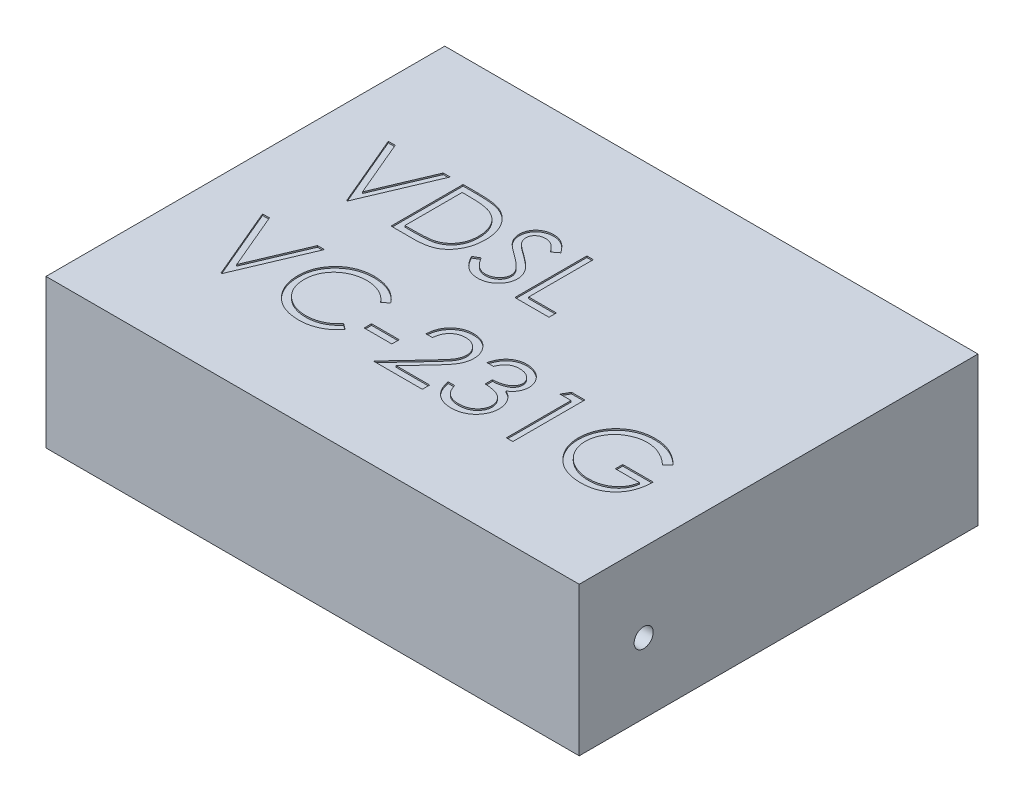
from build123d import *

# Parameters (mm, degrees)
SKETCH1_W           = 94
SKETCH1_H           = 70.3
BOSS_EXTRUDE1_DEPTH = 26.2
SKETCH2_W           = 4.884615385
SKETCH2_H           = 1.302564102
CUT_EXTRUDE1_DEPTH  = 0.254
CUT_EXTRUDE2_DEPTH  = 2.54
SKETCH4_R           = 1.681264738
CUT_EXTRUDE3_DEPTH  = 2.54


with BuildPart() as part:
    # Sketch1 → Boss-Extrude1 (new body)
    with BuildSketch(Plane(origin=(0, 0, 0), x_dir=(1, 0, 0), z_dir=(0, 1, 0))):
        with Locations((47, 35.15)):
            Rectangle(SKETCH1_W, SKETCH1_H)
    extrude(amount=BOSS_EXTRUDE1_DEPTH)

    # Sketch2 → Cut-Extrude1 (cut)
    # profile 1 of 11: a face of its own
    with BuildSketch(Plane(origin=(0, 26.2, 0), x_dir=(1, 0, 0), z_dir=(0, 1, 0))):
        Polygon((9.541282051, 50.8), (10.762435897, 50.8), (14.99322516, 40.799258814), (19.226558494, 50.8), (20.45025641, 50.8), (15.077179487, 38.1), (14.914358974, 38.1), align=None)
    # profile 2 of 11: a face of its own
    with BuildSketch(Plane(origin=(0, 26.2, 0), x_dir=(1, 0, 0), z_dir=(0, 1, 0))):
        with BuildLine():
            Line((22.72974359, 38.1), (22.72974359, 50.8))
            Line((22.72974359, 50.8), (25.294166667, 50.8))
            add(Edge.make_bspline(
                [(25.294166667, 50.8), (25.517211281, 50.798394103), (25.948132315, 50.795291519), (26.570840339, 50.775619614), (27.146998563, 50.740819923), (27.67471208, 50.6901305), (28.15542962, 50.627889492), (28.587805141, 50.549873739), (28.974074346, 50.45775095), (29.211634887, 50.379208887), (29.323974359, 50.342067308)],
                knots=[0, 0, 0, 0, 1.314313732, 2.53924729, 3.670748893, 4.714932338, 5.66265055, 6.526160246, 7.303039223, 8, 8, 8, 8], degree=3))
            add(Edge.make_bspline(
                [(29.323974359, 50.342067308), (29.470912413, 50.28607589), (29.761456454, 50.175362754), (30.175139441, 49.966515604), (30.564577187, 49.729885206), (30.931858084, 49.465159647), (31.268592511, 49.164843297), (31.587935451, 48.841693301), (31.876823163, 48.483958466), (32.141376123, 48.099057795), (32.379902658, 47.691525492), (32.587236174, 47.262138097), (32.759426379, 46.813076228), (32.902367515, 46.345588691), (33.015021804, 45.858647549), (33.091881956, 45.351685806), (33.142576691, 44.826707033), (33.147671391, 44.470473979), (33.15025641, 44.289723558)],
                knots=[0, 0, 0, 0, 0.984719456, 1.947108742, 2.898477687, 3.838006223, 4.779231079, 5.722358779, 6.681677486, 7.655904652, 8.64651281, 9.637519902, 10.640069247, 11.656948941, 12.698408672, 13.768548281, 14.867775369, 16, 16, 16, 16], degree=3))
            add(Edge.make_bspline(
                [(33.15025641, 44.289723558), (33.147974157, 44.132747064), (33.143476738, 43.823408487), (33.103093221, 43.367511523), (33.044396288, 42.925139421), (32.953521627, 42.498398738), (32.843203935, 42.083550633), (32.701819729, 41.685016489), (32.539856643, 41.299140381), (32.350989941, 40.931139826), (32.143648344, 40.582494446), (31.921138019, 40.253834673), (31.683696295, 39.949850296), (31.429058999, 39.669620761), (31.160516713, 39.41356852), (30.876311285, 39.179554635), (30.575709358, 38.972157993), (30.260057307, 38.783228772), (29.920146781, 38.618417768), (29.549539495, 38.478971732), (29.146654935, 38.363414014), (28.712482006, 38.26699962), (28.246270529, 38.190519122), (27.747563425, 38.139260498), (27.217126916, 38.104597), (26.852893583, 38.101562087), (26.665420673, 38.1)],
                knots=[0, 0, 0, 0, 1.105936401, 2.179363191, 3.223086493, 4.248585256, 5.251745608, 6.245858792, 7.225916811, 8.198733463, 9.158002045, 10.082870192, 10.993790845, 11.873723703, 12.748670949, 13.606408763, 14.465103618, 15.319838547, 16.196477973, 17.123216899, 18.106603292, 19.147568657, 20.255746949, 21.433717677, 22.679120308, 24, 24, 24, 24], degree=3))
            Line((26.665420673, 38.1), (22.72974359, 38.1))
        make_face()
        with BuildLine():
            Line((23.869487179, 39.402564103), (25.327239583, 39.402564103))
            add(Edge.make_bspline(
                [(25.327239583, 39.402564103), (25.5367111, 39.403464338), (25.93960154, 39.40519582), (26.518931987, 39.420389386), (27.048265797, 39.445215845), (27.527678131, 39.479959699), (27.956898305, 39.525928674), (28.336823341, 39.577181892), (28.666207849, 39.641035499), (28.865523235, 39.698914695), (28.957628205, 39.725661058)],
                knots=[0, 0, 0, 0, 1.375205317, 2.645023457, 3.804390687, 4.853969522, 5.800190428, 6.637939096, 7.370582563, 8, 8, 8, 8], degree=3))
            add(Edge.make_bspline(
                [(28.957628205, 39.725661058), (29.073555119, 39.76648814), (29.302640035, 39.847167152), (29.632408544, 39.994333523), (29.939955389, 40.168657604), (30.230640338, 40.36243157), (30.500339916, 40.58248992), (30.752250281, 40.824047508), (30.985864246, 41.088333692), (31.198768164, 41.375020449), (31.389298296, 41.682323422), (31.554293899, 42.007221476), (31.698898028, 42.346154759), (31.812394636, 42.704327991), (31.901351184, 43.078539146), (31.964360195, 43.468814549), (32.003602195, 43.875081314), (32.008179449, 44.151404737), (32.010512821, 44.292267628)],
                knots=[0, 0, 0, 0, 0.998632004, 1.973411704, 2.929992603, 3.868527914, 4.809262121, 5.754881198, 6.702106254, 7.672490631, 8.653608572, 9.636854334, 10.631411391, 11.644891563, 12.686317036, 13.754757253, 14.855430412, 16, 16, 16, 16], degree=3))
            add(Edge.make_bspline(
                [(32.010512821, 44.292267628), (32.008650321, 44.440797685), (32.004991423, 44.732586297), (31.959001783, 45.160723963), (31.891794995, 45.572496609), (31.794608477, 45.967931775), (31.670762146, 46.347800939), (31.516204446, 46.710003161), (31.339614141, 47.058363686), (31.129507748, 47.384842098), (30.899399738, 47.693608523), (30.644028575, 47.976473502), (30.367451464, 48.234081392), (30.07268501, 48.470444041), (29.751421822, 48.676052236), (29.411229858, 48.859972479), (29.047118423, 49.016058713), (28.793798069, 49.099076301), (28.665060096, 49.141266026)],
                knots=[0, 0, 0, 0, 1.122418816, 2.205001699, 3.251619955, 4.274784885, 5.280384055, 6.268708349, 7.249350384, 8.229342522, 9.199999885, 10.157847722, 11.105861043, 12.055065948, 13.010012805, 13.98527497, 14.976112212, 16, 16, 16, 16], degree=3))
            add(Edge.make_bspline(
                [(28.665060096, 49.141266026), (28.558557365, 49.170717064), (28.332103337, 49.233338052), (27.962571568, 49.301647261), (27.546682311, 49.361897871), (27.08258911, 49.412908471), (26.570820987, 49.449511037), (26.010984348, 49.476984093), (25.402837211, 49.495513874), (24.981260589, 49.496779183), (24.762455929, 49.497435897)],
                knots=[0, 0, 0, 0, 0.674548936, 1.434276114, 2.292660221, 3.240891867, 4.284742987, 5.42552168, 6.663806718, 8, 8, 8, 8], degree=3))
            Line((24.762455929, 49.497435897), (23.869487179, 49.497435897))
            Line((23.869487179, 49.497435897), (23.869487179, 39.402564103))
        make_face(mode=Mode.SUBTRACT)
    # profile 3 of 11: a face of its own
    with BuildSketch(Plane(origin=(0, 26.2, 0), x_dir=(1, 0, 0), z_dir=(0, 1, 0))):
        with BuildLine():
            Line((34.452820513, 40.549939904), (35.526418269, 41.193589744))
            add(Edge.make_bspline(
                [(35.526418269, 41.193589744), (35.626270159, 41.026441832), (35.817582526, 40.706192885), (36.136720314, 40.273456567), (36.467402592, 39.905656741), (36.812078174, 39.604933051), (37.168643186, 39.368172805), (37.539425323, 39.200524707), (37.923175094, 39.095963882), (38.184337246, 39.083263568), (38.314719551, 39.076923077)],
                knots=[0, 0, 0, 0, 1.272034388, 2.437168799, 3.508375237, 4.49857839, 5.41946034, 6.295179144, 7.148887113, 8, 8, 8, 8], degree=3))
            add(Edge.make_bspline(
                [(38.314719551, 39.076923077), (38.426069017, 39.080024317), (38.646819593, 39.086172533), (38.971802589, 39.145248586), (39.287422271, 39.236006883), (39.587173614, 39.365985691), (39.866920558, 39.523242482), (40.112236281, 39.713184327), (40.324312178, 39.92584113), (40.497790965, 40.163086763), (40.630887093, 40.418237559), (40.733184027, 40.680133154), (40.789953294, 40.952887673), (40.798504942, 41.136531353), (40.802820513, 41.229206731)],
                knots=[0, 0, 0, 0, 1.095163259, 2.171163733, 3.241058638, 4.321873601, 5.38011039, 6.391990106, 7.366004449, 8.327778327, 9.272591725, 10.192022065, 11.087607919, 12, 12, 12, 12], degree=3))
            add(Edge.make_bspline(
                [(40.802820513, 41.229206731), (40.797470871, 41.334946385), (40.786595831, 41.549899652), (40.694678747, 41.867035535), (40.550082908, 42.180880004), (40.416687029, 42.375013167), (40.347431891, 42.475801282)],
                knots=[0, 0, 0, 0, 0.938893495, 1.908633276, 2.914225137, 4, 4, 4, 4], degree=3))
            add(Edge.make_bspline(
                [(40.347431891, 42.475801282), (40.290569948, 42.548542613), (40.171195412, 42.70125394), (39.965972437, 42.928566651), (39.725158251, 43.1630392), (39.456993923, 43.413624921), (39.151711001, 43.668669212), (38.818871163, 43.940334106), (38.449976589, 44.2182884), (38.191261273, 44.404697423), (38.057768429, 44.50088141)],
                knots=[0, 0, 0, 0, 0.722233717, 1.516239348, 2.393582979, 3.351407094, 4.387010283, 5.505090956, 6.712668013, 8, 8, 8, 8], degree=3))
            add(Edge.make_bspline(
                [(38.057768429, 44.50088141), (37.924149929, 44.596053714), (37.668681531, 44.778015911), (37.311417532, 45.048069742), (36.991941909, 45.294971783), (36.711674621, 45.521046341), (36.470738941, 45.726324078), (36.267236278, 45.908833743), (36.106350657, 46.073511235), (36.016886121, 46.180341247), (35.97671875, 46.228305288)],
                knots=[0, 0, 0, 0, 1.452282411, 2.77665338, 3.964542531, 5.026858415, 5.96415736, 6.766646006, 7.446254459, 8, 8, 8, 8], degree=3))
            add(Edge.make_bspline(
                [(35.97671875, 46.228305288), (35.920575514, 46.303057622), (35.810162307, 46.450068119), (35.664417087, 46.679846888), (35.540540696, 46.915062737), (35.443431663, 47.156347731), (35.361657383, 47.400314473), (35.306655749, 47.650146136), (35.272215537, 47.904721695), (35.268688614, 48.076039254), (35.266923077, 48.161798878)],
                knots=[0, 0, 0, 0, 1.068054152, 2.10047183, 3.106115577, 4.101338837, 5.06977816, 6.043150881, 7.020423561, 8, 8, 8, 8], degree=3))
            add(Edge.make_bspline(
                [(35.266923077, 48.161798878), (35.271659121, 48.29616406), (35.281029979, 48.562022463), (35.360279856, 48.950391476), (35.485367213, 49.32118219), (35.660608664, 49.670723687), (35.886513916, 49.989914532), (36.14793788, 50.282426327), (36.459310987, 50.528329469), (36.800950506, 50.743184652), (37.174897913, 50.911354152), (37.56675062, 51.038212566), (37.977131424, 51.110091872), (38.255091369, 51.120407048), (38.396129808, 51.125641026)],
                knots=[0, 0, 0, 0, 1.005424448, 1.989358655, 2.955360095, 3.929531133, 4.905563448, 5.876582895, 6.856512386, 7.866279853, 8.892233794, 9.918561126, 10.94386622, 12, 12, 12, 12], degree=3))
            add(Edge.make_bspline(
                [(38.396129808, 51.125641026), (38.545786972, 51.120479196), (38.843407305, 51.110213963), (39.281191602, 51.020960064), (39.702689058, 50.873274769), (40.041754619, 50.705675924), (40.307122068, 50.538284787), (40.509497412, 50.385812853), (40.714575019, 50.210280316), (40.924009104, 50.011219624), (41.134250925, 49.78680427), (41.348421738, 49.538571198), (41.56702237, 49.26803741), (41.707650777, 49.074908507), (41.77974359, 48.975901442)],
                knots=[0, 0, 0, 0, 1.286793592, 2.559021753, 3.825965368, 5.121522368, 5.803751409, 6.523245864, 7.299691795, 8.125521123, 9.008227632, 9.944561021, 10.946284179, 12, 12, 12, 12], degree=3))
            Line((41.77974359, 48.975901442), (40.749395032, 48.194871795))
            add(Edge.make_bspline(
                [(40.749395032, 48.194871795), (40.687179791, 48.275022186), (40.567367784, 48.429373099), (40.385469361, 48.645531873), (40.214024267, 48.842985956), (40.045112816, 49.014490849), (39.887655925, 49.16943859), (39.734831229, 49.302098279), (39.588838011, 49.413769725), (39.404808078, 49.532944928), (39.173603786, 49.651078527), (38.883374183, 49.751042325), (38.580075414, 49.811113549), (38.373502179, 49.819056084), (38.268926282, 49.823076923)],
                knots=[0, 0, 0, 0, 1.181633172, 2.275549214, 3.290209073, 4.226197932, 5.078386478, 5.862611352, 6.581680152, 7.217281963, 8.414376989, 9.595101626, 10.782541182, 12, 12, 12, 12], degree=3))
            add(Edge.make_bspline(
                [(38.268926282, 49.823076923), (38.137729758, 49.818680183), (37.88472962, 49.810201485), (37.525536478, 49.717600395), (37.202252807, 49.571797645), (36.924476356, 49.367454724), (36.693202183, 49.125352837), (36.525905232, 48.846755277), (36.425211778, 48.539116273), (36.41292442, 48.324516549), (36.406666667, 48.215224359)],
                knots=[0, 0, 0, 0, 1.14458467, 2.207223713, 3.21896685, 4.227309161, 5.202851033, 6.127160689, 7.046193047, 8, 8, 8, 8], degree=3))
            add(Edge.make_bspline(
                [(36.406666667, 48.215224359), (36.408093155, 48.14718328), (36.410948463, 48.010989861), (36.450771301, 47.809780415), (36.501931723, 47.609079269), (36.583003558, 47.409788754), (36.694927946, 47.208423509), (36.84190387, 47.001516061), (37.027009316, 46.787242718), (37.168803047, 46.647878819), (37.243665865, 46.574298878)],
                knots=[0, 0, 0, 0, 0.858281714, 1.717966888, 2.583508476, 3.4729293, 4.427298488, 5.488583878, 6.674047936, 8, 8, 8, 8], degree=3))
            add(Edge.make_bspline(
                [(37.243665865, 46.574298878), (37.271465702, 46.549490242), (37.337511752, 46.4905506), (37.458255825, 46.39405861), (37.617705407, 46.275031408), (37.811696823, 46.127757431), (38.043806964, 45.956918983), (38.314061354, 45.764700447), (38.619447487, 45.544861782), (38.836152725, 45.39116442), (38.950737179, 45.309895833)],
                knots=[0, 0, 0, 0, 0.420754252, 0.999615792, 1.744751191, 2.668019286, 3.750313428, 4.999500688, 6.413464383, 8, 8, 8, 8], degree=3))
            add(Edge.make_bspline(
                [(38.950737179, 45.309895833), (39.088571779, 45.209597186), (39.355469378, 45.015382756), (39.735226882, 44.723588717), (40.079555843, 44.438209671), (40.389665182, 44.161068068), (40.668618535, 43.894266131), (40.913321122, 43.634594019), (41.126266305, 43.383912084), (41.355516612, 43.062520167), (41.589769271, 42.667800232), (41.790942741, 42.184190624), (41.917791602, 41.698701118), (41.934379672, 41.372395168), (41.942564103, 41.211398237)],
                knots=[0, 0, 0, 0, 1.163667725, 2.253281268, 3.268753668, 4.215851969, 5.092017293, 5.902905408, 6.650798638, 7.335211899, 8.59617414, 9.77448103, 10.901945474, 12, 12, 12, 12], degree=3))
            add(Edge.make_bspline(
                [(41.942564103, 41.211398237), (41.94017963, 41.097539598), (41.93545699, 40.872033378), (41.881170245, 40.540907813), (41.801633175, 40.219304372), (41.681755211, 39.911198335), (41.535439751, 39.610953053), (41.349779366, 39.326444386), (41.134577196, 39.051375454), (40.88771182, 38.793081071), (40.617579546, 38.555967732), (40.33207014, 38.34504228), (40.030716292, 38.169171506), (39.7151528, 38.025658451), (39.385307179, 37.913413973), (39.041290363, 37.832087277), (38.68253528, 37.782173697), (38.438693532, 37.776992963), (38.314719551, 37.774358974)],
                knots=[0, 0, 0, 0, 0.983748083, 1.948392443, 2.894712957, 3.844097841, 4.80183111, 5.778335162, 6.776009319, 7.81870978, 8.863265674, 9.881300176, 10.883814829, 11.87499822, 12.874611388, 13.892143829, 14.928324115, 16, 16, 16, 16], degree=3))
            add(Edge.make_bspline(
                [(38.314719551, 37.774358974), (38.218797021, 37.776213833), (38.028160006, 37.779900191), (37.7461856, 37.812489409), (37.469907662, 37.858598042), (37.202792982, 37.931801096), (36.941400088, 38.020617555), (36.686865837, 38.129976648), (36.43906687, 38.261030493), (36.196614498, 38.41087244), (35.96012535, 38.585253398), (35.731817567, 38.788357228), (35.504200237, 39.014582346), (35.283991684, 39.270072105), (35.066737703, 39.550698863), (34.85672176, 39.859088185), (34.64959667, 40.193560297), (34.519637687, 40.428927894), (34.452820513, 40.549939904)],
                knots=[0, 0, 0, 0, 0.915332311, 1.819136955, 2.706846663, 3.586547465, 4.459518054, 5.340707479, 6.227863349, 7.133153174, 8.059268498, 9.028702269, 10.047606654, 11.120612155, 12.245963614, 13.433783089, 14.680604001, 16, 16, 16, 16], degree=3))
        make_face()
    # profile 4 of 11: a face of its own
    with BuildSketch(Plane(origin=(0, 26.2, 0), x_dir=(1, 0, 0), z_dir=(0, 1, 0))):
        Polygon((44.547692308, 50.8), (45.687435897, 50.8), (45.687435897, 39.402564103), (50.572051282, 39.402564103), (50.572051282, 38.1), (44.547692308, 38.1), align=None)
    # profile 5 of 11: a face of its own
    with BuildSketch(Plane(origin=(0, 26.2, 0), x_dir=(1, 0, 0), z_dir=(0, 1, 0))):
        Polygon((9.541282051, 28.633333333), (10.762435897, 28.633333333), (14.99322516, 18.632592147), (19.226558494, 28.633333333), (20.45025641, 28.633333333), (15.077179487, 15.933333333), (14.914358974, 15.933333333), align=None)
    # profile 6 of 11: a face of its own
    with BuildSketch(Plane(origin=(0, 26.2, 0), x_dir=(1, 0, 0), z_dir=(0, 1, 0))):
        with BuildLine():
            Line((34.452820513, 26.302964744), (33.455544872, 25.53974359))
            add(Edge.make_bspline(
                [(33.455544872, 25.53974359), (33.384403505, 25.62452868), (33.243079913, 25.792955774), (33.015716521, 26.029464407), (32.778764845, 26.25104407), (32.532315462, 26.458750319), (32.271932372, 26.645319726), (32.003923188, 26.820474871), (31.723804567, 26.977474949), (31.336448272, 27.167840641), (30.82972608, 27.366490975), (30.19184195, 27.533054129), (29.525958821, 27.639085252), (29.071670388, 27.650569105), (28.840600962, 27.656410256)],
                knots=[0, 0, 0, 0, 0.757959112, 1.505699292, 2.245454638, 2.979532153, 3.711538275, 4.438200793, 5.171680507, 5.909471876, 7.393775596, 8.890124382, 10.418191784, 12, 12, 12, 12], degree=3))
            add(Edge.make_bspline(
                [(28.840600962, 27.656410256), (28.713298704, 27.65494445), (28.459875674, 27.65202644), (28.083779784, 27.613530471), (27.714706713, 27.559424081), (27.352896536, 27.479140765), (26.9988098, 27.377640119), (26.650131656, 27.256353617), (26.311910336, 27.106294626), (25.979467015, 26.94043894), (25.660953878, 26.753105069), (25.359582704, 26.54876805), (25.076452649, 26.329714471), (24.811339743, 26.095123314), (24.563972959, 25.846051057), (24.336144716, 25.579843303), (24.128643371, 25.297351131), (23.93735588, 25.002299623), (23.766041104, 24.695548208), (23.622604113, 24.375961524), (23.495585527, 24.04901235), (23.395076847, 23.711006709), (23.315522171, 23.364322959), (23.260630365, 23.008030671), (23.222572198, 22.642874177), (23.219668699, 22.395371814), (23.218205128, 22.270612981)],
                knots=[0, 0, 0, 0, 1.054917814, 2.100044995, 3.131103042, 4.146048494, 5.169673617, 6.183595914, 7.203665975, 8.234915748, 9.262203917, 10.264457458, 11.251630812, 12.227803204, 13.197192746, 14.159520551, 15.12972552, 16.100847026, 17.073214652, 18.039054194, 19.002613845, 19.979014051, 20.95965708, 21.949030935, 22.966165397, 24, 24, 24, 24], degree=3))
            add(Edge.make_bspline(
                [(23.218205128, 22.270612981), (23.222783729, 22.082902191), (23.231773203, 21.714356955), (23.311777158, 21.174532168), (23.433352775, 20.657385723), (23.615563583, 20.166150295), (23.840241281, 19.694768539), (24.124142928, 19.251216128), (24.452951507, 18.828790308), (24.831318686, 18.437474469), (25.246448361, 18.08001038), (25.691847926, 17.765229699), (26.166408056, 17.502829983), (26.664888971, 17.284477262), (27.191126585, 17.116631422), (27.744174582, 16.998470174), (28.322830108, 16.921391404), (28.718233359, 16.914012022), (28.919467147, 16.91025641)],
                knots=[0, 0, 0, 0, 1.029171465, 2.020641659, 2.987623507, 3.938342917, 4.889210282, 5.84687017, 6.821220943, 7.821438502, 8.827599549, 9.822697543, 10.807740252, 11.797342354, 12.80366471, 13.83203677, 14.896651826, 16, 16, 16, 16], degree=3))
            add(Edge.make_bspline(
                [(28.919467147, 16.91025641), (29.141182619, 16.916384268), (29.577571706, 16.928445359), (30.217535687, 17.030623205), (30.830168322, 17.196296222), (31.415502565, 17.428154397), (31.971888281, 17.729562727), (32.500196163, 18.094952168), (33.000872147, 18.527798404), (33.301939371, 18.858300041), (33.455544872, 19.026923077)],
                knots=[0, 0, 0, 0, 1.028121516, 2.023589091, 2.998037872, 3.967518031, 4.937445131, 5.927275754, 6.942489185, 8, 8, 8, 8], degree=3))
            Line((33.455544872, 19.026923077), (34.452820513, 18.271334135))
            add(Edge.make_bspline(
                [(34.452820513, 18.271334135), (34.372563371, 18.167780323), (34.212433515, 17.961168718), (33.953142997, 17.669897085), (33.679993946, 17.395925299), (33.390957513, 17.141462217), (33.089358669, 16.901416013), (32.769781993, 16.682606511), (32.436428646, 16.481979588), (32.090428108, 16.298276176), (31.732147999, 16.135290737), (31.362017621, 15.995758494), (30.98163239, 15.875562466), (30.590974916, 15.776676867), (30.189234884, 15.69949322), (29.777862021, 15.647896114), (29.355968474, 15.612546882), (29.071338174, 15.609325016), (28.927099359, 15.607692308)],
                knots=[0, 0, 0, 0, 0.986787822, 1.968848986, 2.935600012, 3.899624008, 4.868462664, 5.837806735, 6.815139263, 7.798259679, 8.787526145, 9.778297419, 10.776456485, 11.791383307, 12.812564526, 13.85620153, 14.913611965, 16, 16, 16, 16], degree=3))
            add(Edge.make_bspline(
                [(28.927099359, 15.607692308), (28.790506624, 15.608642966), (28.520411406, 15.610522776), (28.121635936, 15.640974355), (27.7334166, 15.682520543), (27.356862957, 15.74507759), (26.989920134, 15.818898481), (26.635914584, 15.917854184), (26.291362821, 16.028704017), (25.957649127, 16.158987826), (25.634489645, 16.306003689), (25.322926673, 16.472161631), (25.023103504, 16.656064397), (24.732072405, 16.853658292), (24.454132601, 17.071290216), (24.186875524, 17.305937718), (23.928802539, 17.556809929), (23.769135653, 17.737711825), (23.688858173, 17.828665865)],
                knots=[0, 0, 0, 0, 1.114604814, 2.203992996, 3.262667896, 4.300477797, 5.318619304, 6.316056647, 7.298880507, 8.271930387, 9.238335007, 10.195173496, 11.151986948, 12.108099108, 13.064862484, 14.031167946, 15.010108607, 16, 16, 16, 16], degree=3))
            add(Edge.make_bspline(
                [(23.688858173, 17.828665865), (23.56027741, 17.986658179), (23.304668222, 18.300735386), (22.977640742, 18.809773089), (22.697705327, 19.341243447), (22.471369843, 19.897938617), (22.294430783, 20.478609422), (22.171853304, 21.083548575), (22.092200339, 21.712191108), (22.083091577, 22.139770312), (22.078461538, 22.357111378)],
                knots=[0, 0, 0, 0, 0.994628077, 1.977248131, 2.950237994, 3.925870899, 4.908910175, 5.911660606, 6.938484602, 8, 8, 8, 8], degree=3))
            add(Edge.make_bspline(
                [(22.078461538, 22.357111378), (22.084104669, 22.585549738), (22.095207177, 23.03498795), (22.189534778, 23.694567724), (22.341277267, 24.326488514), (22.55680312, 24.929570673), (22.830053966, 25.506986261), (23.167607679, 26.054324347), (23.565542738, 26.575085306), (24.020738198, 27.061367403), (24.5199111, 27.506010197), (25.054467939, 27.897192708), (25.623362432, 28.222739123), (26.220327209, 28.494868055), (26.849832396, 28.704035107), (27.510534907, 28.850459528), (28.201193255, 28.941598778), (28.672408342, 28.953120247), (28.911834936, 28.958974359)],
                knots=[0, 0, 0, 0, 1.032925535, 2.032216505, 3.007276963, 3.968222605, 4.92396291, 5.891752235, 6.871517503, 7.883894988, 8.900124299, 9.891468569, 10.874487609, 11.85992873, 12.854644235, 13.869047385, 14.917252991, 16, 16, 16, 16], degree=3))
            add(Edge.make_bspline(
                [(28.911834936, 28.958974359), (29.05775602, 28.957224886), (29.34659211, 28.953761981), (29.77386602, 28.919993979), (30.189853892, 28.863701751), (30.594842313, 28.787080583), (30.99080152, 28.691985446), (31.374705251, 28.568104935), (31.748806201, 28.426458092), (32.110744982, 28.263323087), (32.458785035, 28.080200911), (32.792817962, 27.879121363), (33.11019045, 27.660333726), (33.4131357, 27.425698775), (33.696585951, 27.170252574), (33.968589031, 26.901021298), (34.2199078, 26.610249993), (34.375040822, 26.405580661), (34.452820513, 26.302964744)],
                knots=[0, 0, 0, 0, 1.096760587, 2.17092713, 3.219439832, 4.250915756, 5.268269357, 6.278326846, 7.281116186, 8.274029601, 9.260640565, 10.235837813, 11.203064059, 12.156899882, 13.114053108, 14.069676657, 15.032185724, 16, 16, 16, 16], degree=3))
        make_face()
    # profile 7 of 11: a face of its own
    with BuildSketch(Plane(origin=(0, 26.2, 0), x_dir=(1, 0, 0), z_dir=(0, 1, 0))):
        with Locations((38.360512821, 20.817948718)):
            Rectangle(SKETCH2_W, SKETCH2_H)
    # profile 8 of 11: a face of its own
    with BuildSketch(Plane(origin=(0, 26.2, 0), x_dir=(1, 0, 0), z_dir=(0, 1, 0))):
        with BuildLine():
            Line((43.407948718, 24.725641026), (42.268205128, 24.725641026))
            add(Edge.make_bspline(
                [(42.268205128, 24.725641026), (42.275633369, 24.876846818), (42.290222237, 25.173810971), (42.358542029, 25.606786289), (42.456298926, 26.020642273), (42.594516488, 26.412055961), (42.766170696, 26.784488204), (42.972019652, 27.136459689), (43.215837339, 27.466627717), (43.492358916, 27.77193152), (43.792690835, 28.052012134), (44.116743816, 28.293875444), (44.4572672, 28.498228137), (44.813227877, 28.669065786), (45.188641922, 28.797298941), (45.580102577, 28.892446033), (45.989329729, 28.94969163), (46.268149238, 28.95584491), (46.409951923, 28.958974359)],
                knots=[0, 0, 0, 0, 1.10065271, 2.161652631, 3.183658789, 4.190468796, 5.17591951, 6.163126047, 7.15150782, 8.156236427, 9.156009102, 10.134482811, 11.092018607, 12.041330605, 13.001268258, 13.972401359, 14.968799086, 16, 16, 16, 16], degree=3))
            add(Edge.make_bspline(
                [(46.409951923, 28.958974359), (46.549209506, 28.955714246), (46.822845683, 28.949308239), (47.222213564, 28.894295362), (47.602405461, 28.808132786), (47.962678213, 28.687245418), (48.300157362, 28.524741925), (48.617378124, 28.329533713), (48.918117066, 28.103764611), (49.188833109, 27.837957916), (49.437419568, 27.554194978), (49.651876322, 27.251253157), (49.835529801, 26.938364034), (49.988610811, 26.613141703), (50.10130023, 26.272523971), (50.186855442, 25.921469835), (50.235214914, 25.556345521), (50.242636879, 25.309216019), (50.246410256, 25.183573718)],
                knots=[0, 0, 0, 0, 1.111607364, 2.184268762, 3.212621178, 4.221274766, 5.211760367, 6.196651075, 7.1921475, 8.207485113, 9.220403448, 10.201281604, 11.166441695, 12.114753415, 13.065576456, 14.026450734, 14.996634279, 16, 16, 16, 16], degree=3))
            add(Edge.make_bspline(
                [(50.246410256, 25.183573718), (50.240290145, 25.006681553), (50.228157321, 24.65600143), (50.123452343, 24.140002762), (49.96168302, 23.639604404), (49.76547517, 23.236908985), (49.567280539, 22.914049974), (49.392456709, 22.64584179), (49.183261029, 22.359814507), (48.941607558, 22.05308734), (48.671141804, 21.724722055), (48.369917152, 21.374583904), (48.035632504, 21.006391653), (47.801015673, 20.754910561), (47.679443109, 20.624599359)],
                knots=[0, 0, 0, 0, 1.184203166, 2.347625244, 3.513805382, 4.700623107, 5.337941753, 6.051866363, 6.845199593, 7.711357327, 8.668078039, 9.695487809, 10.805859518, 12, 12, 12, 12], degree=3))
            Line((47.679443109, 20.624599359), (44.501899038, 17.235897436))
            Line((44.501899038, 17.235897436), (50.409230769, 17.235897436))
            Line((50.409230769, 17.235897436), (50.409230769, 15.933333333))
            Line((50.409230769, 15.933333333), (41.77974359, 15.933333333))
            Line((41.77974359, 15.933333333), (46.705064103, 21.189383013))
            add(Edge.make_bspline(
                [(46.705064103, 21.189383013), (46.82498072, 21.314562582), (47.055316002, 21.555006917), (47.381098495, 21.906045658), (47.673702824, 22.231708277), (47.935023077, 22.531379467), (48.159390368, 22.809442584), (48.358498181, 23.056891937), (48.518030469, 23.284600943), (48.69116919, 23.548545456), (48.858859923, 23.870807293), (49.002959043, 24.264629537), (49.09082435, 24.670039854), (49.101364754, 24.944004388), (49.106666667, 25.081810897)],
                knots=[0, 0, 0, 0, 1.329631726, 2.553950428, 3.673215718, 4.687767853, 5.603093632, 6.413772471, 7.123043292, 7.734684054, 8.834405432, 9.900288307, 10.943827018, 12, 12, 12, 12], degree=3))
            add(Edge.make_bspline(
                [(49.106666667, 25.081810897), (49.10435983, 25.168466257), (49.099813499, 25.339247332), (49.059689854, 25.589639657), (48.999054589, 25.831174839), (48.91216751, 26.064595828), (48.797480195, 26.287555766), (48.657876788, 26.500326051), (48.496804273, 26.70602601), (48.310472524, 26.898896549), (48.105779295, 27.07553978), (47.889537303, 27.232018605), (47.660755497, 27.362789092), (47.420398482, 27.469989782), (47.16913635, 27.554083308), (46.906483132, 27.612353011), (46.633164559, 27.648938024), (46.446534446, 27.653888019), (46.351438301, 27.656410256)],
                knots=[0, 0, 0, 0, 0.991446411, 1.95395049, 2.89581595, 3.838931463, 4.798493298, 5.75982156, 6.748411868, 7.785213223, 8.824556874, 9.840280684, 10.836137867, 11.835679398, 12.848801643, 13.863922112, 14.911575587, 16, 16, 16, 16], degree=3))
            add(Edge.make_bspline(
                [(46.351438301, 27.656410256), (46.25212128, 27.653815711), (46.057079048, 27.648720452), (45.770715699, 27.613078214), (45.497535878, 27.551589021), (45.236852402, 27.467490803), (44.98822419, 27.360598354), (44.752860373, 27.227459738), (44.531289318, 27.068588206), (44.323094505, 26.888463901), (44.131273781, 26.687921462), (43.962737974, 26.464365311), (43.81547598, 26.221877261), (43.686991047, 25.961111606), (43.582648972, 25.679702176), (43.502917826, 25.378647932), (43.43982841, 25.059256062), (43.418751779, 24.83869304), (43.407948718, 24.725641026)],
                knots=[0, 0, 0, 0, 1.031018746, 2.02475058, 2.990194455, 3.934040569, 4.864654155, 5.795059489, 6.735614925, 7.690564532, 8.649604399, 9.611025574, 10.590972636, 11.591080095, 12.624614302, 13.701020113, 14.821632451, 16, 16, 16, 16], degree=3))
        make_face()
    # profile 9 of 11: a face of its own
    with BuildSketch(Plane(origin=(0, 26.2, 0), x_dir=(1, 0, 0), z_dir=(0, 1, 0))):
        with BuildLine():
            Line((53.177179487, 25.702564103), (52.037435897, 25.702564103))
            add(Edge.make_bspline(
                [(52.037435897, 25.702564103), (52.06831341, 25.830407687), (52.128676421, 26.080331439), (52.254579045, 26.437409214), (52.391736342, 26.775314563), (52.55643395, 27.087720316), (52.736080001, 27.380904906), (52.941902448, 27.648218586), (53.164405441, 27.896459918), (53.410513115, 28.116762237), (53.668608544, 28.316252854), (53.94232845, 28.486342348), (54.226165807, 28.632661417), (54.522087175, 28.753203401), (54.83097357, 28.844010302), (55.150032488, 28.909893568), (55.480100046, 28.952678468), (55.704155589, 28.956854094), (55.817924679, 28.958974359)],
                knots=[0, 0, 0, 0, 1.162005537, 2.271625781, 3.343758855, 4.383309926, 5.390229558, 6.379919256, 7.361854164, 8.333198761, 9.295911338, 10.242430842, 11.177959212, 12.116337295, 13.062827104, 14.020064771, 14.994644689, 16, 16, 16, 16], degree=3))
            add(Edge.make_bspline(
                [(55.817924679, 28.958974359), (55.983687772, 28.953969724), (56.311598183, 28.944069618), (56.793338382, 28.853665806), (57.25789284, 28.710608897), (57.700176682, 28.512947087), (58.110997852, 28.269153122), (58.476526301, 27.978995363), (58.791807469, 27.648072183), (59.056309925, 27.282556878), (59.263410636, 26.891921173), (59.416124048, 26.489874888), (59.509094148, 26.077371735), (59.521143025, 25.798852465), (59.527179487, 25.659314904)],
                knots=[0, 0, 0, 0, 1.083050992, 2.142477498, 3.193116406, 4.255571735, 5.30263384, 6.308962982, 7.297363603, 8.282367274, 9.249857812, 10.179914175, 11.08814088, 12, 12, 12, 12], degree=3))
            add(Edge.make_bspline(
                [(59.527179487, 25.659314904), (59.522957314, 25.525033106), (59.514695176, 25.262264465), (59.444541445, 24.878646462), (59.326481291, 24.517089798), (59.162942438, 24.176072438), (58.951245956, 23.857756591), (58.694805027, 23.561426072), (58.391809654, 23.285766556), (58.162197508, 23.127853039), (58.043986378, 23.046554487)],
                knots=[0, 0, 0, 0, 1.024540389, 2.004866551, 2.965041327, 3.920577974, 4.882998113, 5.874504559, 6.905732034, 8, 8, 8, 8], degree=3))
            add(Edge.make_bspline(
                [(58.043986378, 23.046554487), (58.179084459, 22.981319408), (58.446752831, 22.852069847), (58.81160761, 22.598593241), (59.142815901, 22.305925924), (59.327523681, 22.077534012), (59.420328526, 21.962780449)],
                knots=[0, 0, 0, 0, 1.015518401, 2.012035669, 3.001164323, 4, 4, 4, 4], degree=3))
            add(Edge.make_bspline(
                [(59.420328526, 21.962780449), (59.481438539, 21.87911375), (59.602657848, 21.713150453), (59.752283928, 21.446318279), (59.888025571, 21.176528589), (59.993799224, 20.896550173), (60.075710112, 20.609628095), (60.134260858, 20.315269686), (60.170634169, 20.013234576), (60.175843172, 19.808900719), (60.178461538, 19.706189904)],
                knots=[0, 0, 0, 0, 1.025084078, 2.033381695, 3.024893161, 4.013698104, 4.991890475, 5.976764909, 6.982997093, 8, 8, 8, 8], degree=3))
            add(Edge.make_bspline(
                [(60.178461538, 19.706189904), (60.171950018, 19.52835463), (60.15895762, 19.173520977), (60.042828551, 18.64928413), (59.862803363, 18.136837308), (59.607145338, 17.646708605), (59.295568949, 17.188128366), (58.924883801, 16.777822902), (58.499301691, 16.425130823), (58.024664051, 16.13045371), (57.510433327, 15.894894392), (56.960430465, 15.731400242), (56.382580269, 15.624916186), (55.986313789, 15.613497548), (55.784851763, 15.607692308)],
                knots=[0, 0, 0, 0, 0.955779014, 1.907060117, 2.875433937, 3.871313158, 4.872415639, 5.851225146, 6.836215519, 7.83643374, 8.849228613, 9.86973379, 10.916971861, 12, 12, 12, 12], degree=3))
            add(Edge.make_bspline(
                [(55.784851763, 15.607692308), (55.649073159, 15.610842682), (55.381906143, 15.617041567), (54.989136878, 15.659418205), (54.614226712, 15.736815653), (54.256668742, 15.840967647), (53.916145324, 15.973017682), (53.593695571, 16.137459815), (53.287335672, 16.330904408), (52.999956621, 16.555634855), (52.731592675, 16.807027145), (52.489375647, 17.089544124), (52.269267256, 17.397963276), (52.077161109, 17.735866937), (51.904307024, 18.098888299), (51.762136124, 18.491675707), (51.637002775, 18.91071773), (51.578824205, 19.202736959), (51.548974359, 19.352564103)],
                knots=[0, 0, 0, 0, 1.048658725, 2.063410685, 3.046034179, 4.001477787, 4.936774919, 5.862367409, 6.792675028, 7.730719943, 8.675894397, 9.627829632, 10.600096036, 11.597688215, 12.626045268, 13.701542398, 14.82072376, 16, 16, 16, 16], degree=3))
            Line((51.548974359, 19.352564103), (52.688717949, 19.352564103))
            add(Edge.make_bspline(
                [(52.688717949, 19.352564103), (52.718411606, 19.254777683), (52.776168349, 19.064574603), (52.874481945, 18.790834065), (52.986489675, 18.539889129), (53.106648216, 18.309898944), (53.232844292, 18.098598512), (53.374049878, 17.911575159), (53.51980649, 17.740614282), (53.629677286, 17.644295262), (53.683449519, 17.597155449)],
                knots=[0, 0, 0, 0, 1.198163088, 2.33053128, 3.407730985, 4.417276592, 5.372219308, 6.28897303, 7.162600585, 8, 8, 8, 8], degree=3))
            add(Edge.make_bspline(
                [(53.683449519, 17.597155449), (53.754557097, 17.54233378), (53.896552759, 17.432859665), (54.127940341, 17.293153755), (54.37129007, 17.172100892), (54.631874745, 17.079631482), (54.904071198, 17.001335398), (55.192279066, 16.950098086), (55.493955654, 16.914943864), (55.699941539, 16.911841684), (55.805204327, 16.91025641)],
                knots=[0, 0, 0, 0, 0.946170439, 1.889420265, 2.845303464, 3.807233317, 4.801018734, 5.828864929, 6.890507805, 8, 8, 8, 8], degree=3))
            add(Edge.make_bspline(
                [(55.805204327, 16.91025641), (55.924052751, 16.912491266), (56.156450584, 16.916861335), (56.495558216, 16.957050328), (56.81816524, 17.015580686), (57.120689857, 17.105979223), (57.407094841, 17.217669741), (57.673365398, 17.357908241), (57.922996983, 17.522444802), (58.152792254, 17.709458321), (58.359423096, 17.914187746), (58.541357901, 18.12832089), (58.69602453, 18.3509549), (58.820787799, 18.583321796), (58.91930551, 18.82445934), (58.986373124, 19.075044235), (59.033005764, 19.333025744), (59.036803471, 19.50839086), (59.038717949, 19.596794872)],
                knots=[0, 0, 0, 0, 1.217147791, 2.380027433, 3.494444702, 4.572153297, 5.609568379, 6.639424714, 7.649109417, 8.668170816, 9.669597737, 10.625200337, 11.543417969, 12.441394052, 13.322311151, 14.205496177, 15.095365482, 16, 16, 16, 16], degree=3))
            add(Edge.make_bspline(
                [(59.038717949, 19.596794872), (59.03316514, 19.715127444), (59.022087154, 19.951203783), (58.937510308, 20.298521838), (58.798395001, 20.633161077), (58.60364046, 20.949412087), (58.366565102, 21.242513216), (58.089469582, 21.504029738), (57.770052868, 21.719821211), (57.476066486, 21.868914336), (57.21566149, 21.970648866), (56.99281138, 22.038412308), (56.743323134, 22.095793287), (56.470213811, 22.149177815), (56.171425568, 22.194612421), (55.847283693, 22.232501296), (55.497722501, 22.262818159), (55.255728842, 22.276356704), (55.131025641, 22.283333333)],
                knots=[0, 0, 0, 0, 1.07054697, 2.135767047, 3.216561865, 4.33974944, 5.486079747, 6.621378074, 7.775625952, 8.963672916, 9.598146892, 10.304877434, 11.070270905, 11.915000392, 12.823868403, 13.805723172, 14.86925407, 16, 16, 16, 16], degree=3))
            Line((55.131025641, 22.283333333), (55.131025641, 23.585897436))
            add(Edge.make_bspline(
                [(55.131025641, 23.585897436), (55.288147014, 23.588563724), (55.595909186, 23.593786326), (56.04546852, 23.656952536), (56.475357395, 23.744330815), (56.876048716, 23.878171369), (57.241259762, 24.033620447), (57.558105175, 24.21451275), (57.822145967, 24.415589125), (58.032098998, 24.639953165), (58.190047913, 24.880582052), (58.305533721, 25.131376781), (58.373752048, 25.394535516), (58.382858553, 25.574130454), (58.387435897, 25.664403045)],
                knots=[0, 0, 0, 0, 1.321986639, 2.589447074, 3.816329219, 5.01088745, 6.139805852, 7.153945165, 8.075214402, 8.924034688, 9.728124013, 10.488707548, 11.240355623, 12, 12, 12, 12], degree=3))
            add(Edge.make_bspline(
                [(58.387435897, 25.664403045), (58.385932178, 25.730725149), (58.382940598, 25.862669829), (58.345213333, 26.055437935), (58.288520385, 26.242312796), (58.210579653, 26.422499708), (58.106257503, 26.594748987), (57.981412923, 26.760529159), (57.832757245, 26.918893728), (57.662412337, 27.066505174), (57.479489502, 27.20718212), (57.279011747, 27.326611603), (57.067023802, 27.428737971), (56.843290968, 27.512955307), (56.607087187, 27.576307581), (56.359522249, 27.621794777), (56.100124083, 27.650234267), (55.92315237, 27.654328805), (55.833189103, 27.656410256)],
                knots=[0, 0, 0, 0, 0.884392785, 1.759457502, 2.611959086, 3.489218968, 4.37281399, 5.2945488, 6.255912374, 7.266815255, 8.301784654, 9.332968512, 10.37626691, 11.440494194, 12.520033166, 13.637162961, 14.798855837, 16, 16, 16, 16], degree=3))
            add(Edge.make_bspline(
                [(55.833189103, 27.656410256), (55.688584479, 27.6513616), (55.406138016, 27.6415004), (54.998958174, 27.555129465), (54.62042802, 27.417323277), (54.331090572, 27.252829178), (54.117430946, 27.090449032), (53.96475177, 26.948635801), (53.814817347, 26.791036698), (53.677491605, 26.607944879), (53.538611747, 26.411759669), (53.412175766, 26.192508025), (53.289313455, 25.955909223), (53.215281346, 25.78864792), (53.177179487, 25.702564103)],
                knots=[0, 0, 0, 0, 1.472543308, 2.876219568, 4.221790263, 5.565193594, 6.249813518, 6.953379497, 7.687249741, 8.463570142, 9.283606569, 10.136032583, 11.040678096, 12, 12, 12, 12], degree=3))
        make_face()
    # profile 10 of 11: a face of its own
    with BuildSketch(Plane(origin=(0, 26.2, 0), x_dir=(1, 0, 0), z_dir=(0, 1, 0))):
        Polygon((64.017463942, 28.633333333), (66.365641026, 28.633333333), (66.365641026, 15.933333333), (65.225897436, 15.933333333), (65.225897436, 27.330769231), (63.272051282, 27.330769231), align=None)
    # profile 11 of 11: a face of its own
    with BuildSketch(Plane(origin=(0, 26.2, 0), x_dir=(1, 0, 0), z_dir=(0, 1, 0))):
        with BuildLine():
            Line((84.113076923, 26.465785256), (83.136153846, 25.53974359))
            add(Edge.make_bspline(
                [(83.136153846, 25.53974359), (82.959373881, 25.70604415), (82.610029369, 26.034679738), (82.040487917, 26.461076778), (81.446259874, 26.826350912), (80.830445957, 27.123553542), (80.208296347, 27.360690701), (79.588069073, 27.529521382), (78.976126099, 27.637190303), (78.569119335, 27.650065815), (78.368565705, 27.656410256)],
                knots=[0, 0, 0, 0, 1.08915593, 2.152340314, 3.188132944, 4.216796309, 5.218260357, 6.173443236, 7.099959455, 8, 8, 8, 8], degree=3))
            add(Edge.make_bspline(
                [(78.368565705, 27.656410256), (78.245503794, 27.654909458), (77.999699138, 27.651911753), (77.634585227, 27.613651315), (77.273300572, 27.558624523), (76.916527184, 27.479006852), (76.563571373, 27.378099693), (76.215660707, 27.251878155), (75.872146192, 27.104720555), (75.536263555, 26.934676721), (75.210633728, 26.747878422), (74.903087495, 26.540873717), (74.611664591, 26.320297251), (74.341842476, 26.080626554), (74.092069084, 25.824032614), (73.856399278, 25.555288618), (73.643121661, 25.267052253), (73.450476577, 24.964626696), (73.278621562, 24.653323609), (73.126915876, 24.336139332), (72.999563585, 24.014125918), (72.898800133, 23.686879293), (72.815667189, 23.356931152), (72.7571833, 23.021996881), (72.724211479, 22.681717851), (72.718508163, 22.453853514), (72.715641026, 22.339302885)],
                knots=[0, 0, 0, 0, 1.02818874, 2.053710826, 3.065248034, 4.081641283, 5.106893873, 6.131558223, 7.173050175, 8.228653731, 9.27666206, 10.308777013, 11.325269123, 12.329503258, 13.32196095, 14.316845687, 15.314881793, 16.315733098, 17.311955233, 18.285320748, 19.252783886, 20.203351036, 21.145449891, 22.095197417, 23.042428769, 24, 24, 24, 24], degree=3))
            add(Edge.make_bspline(
                [(72.715641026, 22.339302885), (72.718383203, 22.222205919), (72.723860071, 21.988331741), (72.75891323, 21.639284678), (72.823967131, 21.295421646), (72.910935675, 20.955612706), (73.019723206, 20.619275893), (73.155332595, 20.287869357), (73.315953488, 19.961405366), (73.501868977, 19.642825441), (73.705744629, 19.332499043), (73.934138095, 19.040183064), (74.176746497, 18.761984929), (74.442408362, 18.504081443), (74.722604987, 18.259574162), (75.025707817, 18.035199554), (75.345756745, 17.826635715), (75.683240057, 17.636511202), (76.034495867, 17.466663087), (76.394656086, 17.315627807), (76.764871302, 17.191242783), (77.143195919, 17.089867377), (77.529178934, 17.006772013), (77.924779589, 16.953314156), (78.327089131, 16.914521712), (78.598283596, 16.911685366), (78.734911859, 16.91025641)],
                knots=[0, 0, 0, 0, 0.93586088, 1.869166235, 2.799637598, 3.729985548, 4.670839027, 5.622275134, 6.589130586, 7.576015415, 8.568469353, 9.55398029, 10.53834874, 11.515998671, 12.510579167, 13.508179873, 14.527009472, 15.561807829, 16.601455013, 17.643573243, 18.680854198, 19.719860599, 20.772568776, 21.833555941, 22.908541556, 24, 24, 24, 24], degree=3))
            add(Edge.make_bspline(
                [(78.734911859, 16.91025641), (78.899570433, 16.913698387), (79.222904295, 16.920457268), (79.698197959, 16.973072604), (80.154683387, 17.055248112), (80.591077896, 17.175592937), (81.007888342, 17.329094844), (81.40664273, 17.514135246), (81.784201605, 17.737811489), (82.141699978, 17.990265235), (82.471018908, 18.271533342), (82.768032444, 18.575043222), (83.028003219, 18.899321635), (83.254805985, 19.242458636), (83.442434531, 19.607294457), (83.596441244, 19.992041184), (83.714490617, 20.39687187), (83.762950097, 20.676604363), (83.787435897, 20.817948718)],
                knots=[0, 0, 0, 0, 1.13008108, 2.219097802, 3.278683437, 4.311054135, 5.322181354, 6.324827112, 7.324222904, 8.330512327, 9.32562643, 10.293043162, 11.24128371, 12.174520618, 13.111833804, 14.052305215, 15.015860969, 16, 16, 16, 16], degree=3))
            Line((83.787435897, 20.817948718), (79.554102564, 20.817948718))
            Line((79.554102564, 20.817948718), (79.554102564, 22.120512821))
            Line((79.554102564, 22.120512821), (84.927179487, 22.120512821))
            add(Edge.make_bspline(
                [(84.927179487, 22.120512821), (84.920989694, 21.877734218), (84.908875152, 21.402572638), (84.823897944, 20.70962337), (84.686678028, 20.055131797), (84.499224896, 19.438408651), (84.256563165, 18.8603279), (83.961297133, 18.320302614), (83.608701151, 17.821821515), (83.211334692, 17.360815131), (82.765383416, 16.949591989), (82.282897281, 16.588164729), (81.763079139, 16.283718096), (81.206420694, 16.036029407), (80.614744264, 15.842720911), (79.986680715, 15.705664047), (79.323081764, 15.623549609), (78.868288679, 15.613058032), (78.635693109, 15.607692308)],
                knots=[0, 0, 0, 0, 1.140356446, 2.231883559, 3.274166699, 4.278491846, 5.25512956, 6.21435461, 7.1637429, 8.11826594, 9.068280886, 10.0076534, 10.945064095, 11.891975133, 12.864533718, 13.863980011, 14.907571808, 16, 16, 16, 16], degree=3))
            add(Edge.make_bspline(
                [(78.635693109, 15.607692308), (78.492327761, 15.609757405), (78.209565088, 15.613830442), (77.791949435, 15.642776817), (77.385848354, 15.687337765), (76.991321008, 15.75463007), (76.606916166, 15.837051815), (76.234553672, 15.942595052), (75.872815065, 16.064764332), (75.521141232, 16.203722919), (75.182724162, 16.364728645), (74.856056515, 16.543652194), (74.539332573, 16.73957096), (74.234709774, 16.955873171), (73.940600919, 17.190940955), (73.658902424, 17.445245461), (73.388037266, 17.718009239), (73.218363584, 17.911698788), (73.13286859, 18.009294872)],
                knots=[0, 0, 0, 0, 1.107784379, 2.184907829, 3.233506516, 4.263428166, 5.276301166, 6.270063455, 7.25232949, 8.225834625, 9.190232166, 10.146266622, 11.1027726, 12.066435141, 13.031522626, 14.010570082, 14.99756817, 16, 16, 16, 16], degree=3))
            add(Edge.make_bspline(
                [(73.13286859, 18.009294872), (73.008822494, 18.164128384), (72.762789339, 18.471225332), (72.446094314, 18.963259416), (72.176123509, 19.472717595), (71.957074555, 20.001018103), (71.786030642, 20.54766679), (71.663362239, 21.111965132), (71.591490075, 21.694639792), (71.581135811, 22.088939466), (71.575897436, 22.288421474)],
                knots=[0, 0, 0, 0, 1.023165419, 2.029347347, 3.013907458, 3.994755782, 4.975994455, 5.96558838, 6.970761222, 8, 8, 8, 8], degree=3))
            add(Edge.make_bspline(
                [(71.575897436, 22.288421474), (71.5778287, 22.437796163), (71.581666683, 22.734647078), (71.628204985, 23.175363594), (71.694975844, 23.608254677), (71.793118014, 24.032966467), (71.916838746, 24.449782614), (72.071247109, 24.858896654), (72.251024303, 25.260550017), (72.459977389, 25.651978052), (72.692512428, 26.027986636), (72.94488037, 26.387062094), (73.220664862, 26.722665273), (73.515362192, 27.039046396), (73.832488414, 27.332230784), (74.169072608, 27.604932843), (74.525374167, 27.857518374), (74.90251402, 28.086008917), (75.294863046, 28.291254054), (75.701480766, 28.471192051), (76.122243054, 28.619902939), (76.553997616, 28.746082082), (77.000012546, 28.839391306), (77.457051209, 28.907059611), (77.927495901, 28.953362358), (78.245489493, 28.957086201), (78.406726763, 28.958974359)],
                knots=[0, 0, 0, 0, 1.008945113, 2.00506715, 2.99143336, 3.967273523, 4.948097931, 5.927297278, 6.919902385, 7.919676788, 8.923139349, 9.905703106, 10.883022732, 11.856032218, 12.825136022, 13.798837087, 14.781400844, 15.773989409, 16.776158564, 17.77167057, 18.775803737, 19.789618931, 20.80898985, 21.851988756, 22.910860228, 24, 24, 24, 24], degree=3))
            add(Edge.make_bspline(
                [(78.406726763, 28.958974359), (78.538219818, 28.956871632), (78.798955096, 28.952702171), (79.186942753, 28.923801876), (79.568933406, 28.877995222), (79.945493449, 28.815486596), (80.315340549, 28.73034692), (80.679528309, 28.628462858), (81.038584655, 28.509838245), (81.391384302, 28.368364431), (81.740299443, 28.207786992), (82.087270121, 28.027035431), (82.431110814, 27.823018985), (82.772417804, 27.595131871), (83.113343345, 27.34728804), (83.448495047, 27.072398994), (83.785962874, 26.781304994), (84.002958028, 26.57200107), (84.113076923, 26.465785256)],
                knots=[0, 0, 0, 0, 0.985871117, 1.954866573, 2.915460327, 3.869826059, 4.81536089, 5.759505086, 6.70452669, 7.649098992, 8.607881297, 9.583363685, 10.581137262, 11.603961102, 12.659522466, 13.73993555, 14.853081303, 16, 16, 16, 16], degree=3))
        make_face()
    extrude(amount=-CUT_EXTRUDE1_DEPTH, mode=Mode.SUBTRACT)

    # Sketch3 → Cut-Extrude2 (cut)
    with BuildSketch(Plane.ZY):
        Polygon((-10.963333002, 10.097907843), (-8.810889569, 10.097907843), (-8.810889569, 15.648946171), (-19.969609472, 15.648946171), (-19.969609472, 10.097907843), (-17.817166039, 10.097907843), (-17.817166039, 9.18386914), (-15.947938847, 9.18386914), (-15.947938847, 7.98551784), (-12.832560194, 7.98551784), (-12.832560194, 9.18386914), (-10.963333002, 9.18386914), align=None)
        Polygon((-36.396151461, 15.195800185), (-34.073778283, 15.195800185), (-34.073778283, 9.18386914), (-36.396151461, 9.18386914), (-36.396151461, 7.98551784), (-39.794746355, 7.98551784), (-39.794746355, 9.18386914), (-42.117119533, 9.18386914), (-42.117119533, 15.195800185), (-39.794746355, 15.195800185), (-39.794746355, 16.272021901), (-36.396151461, 16.272021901), align=None)
    extrude(amount=-CUT_EXTRUDE2_DEPTH, mode=Mode.SUBTRACT)

    # Sketch4 → Cut-Extrude3 (cut)
    with BuildSketch(Plane(origin=(94, 0, 0), x_dir=(0, 0, -1), z_dir=(1, 0, 0))):
        with Locations((11.35983574, 12.363637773)):
            Circle(SKETCH4_R)
    extrude(amount=-CUT_EXTRUDE3_DEPTH, mode=Mode.SUBTRACT)


solid = part.part
